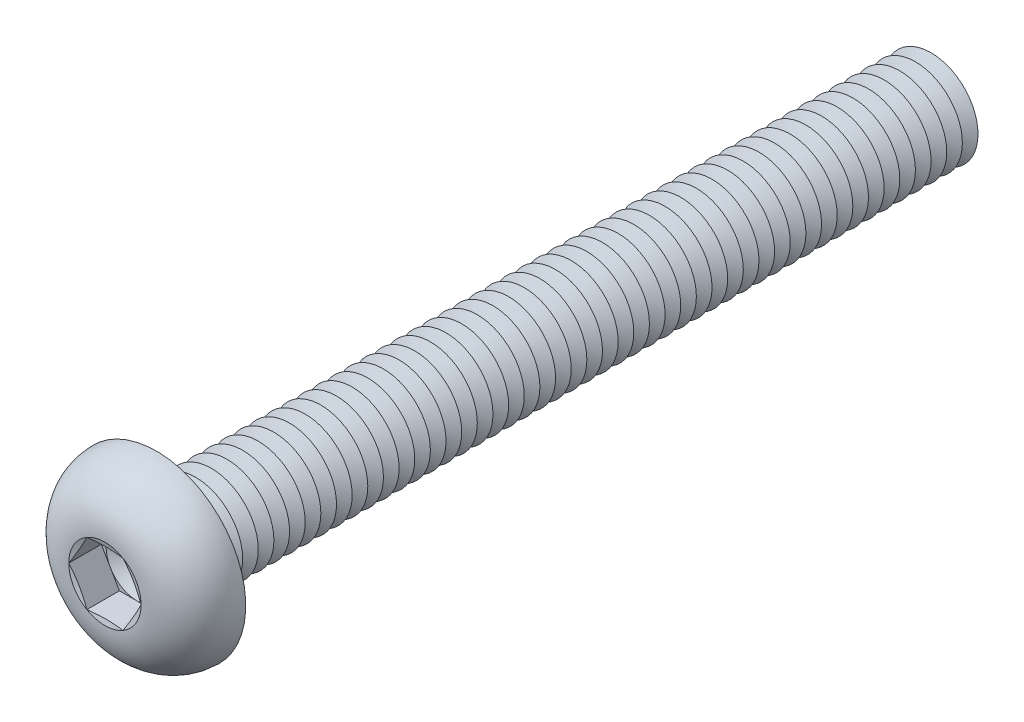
from build123d import *

# Parameters (mm, degrees)
FILLET1_R          = 0.25
LPATTERN1_COUNT    = 50
LPATTERN1_PITCH    = 0.5
CUT_EXTRUDE1_DEPTH = 1.04


with BuildPart() as part:
    # Sketch1 → Revolve1 (revolve)
    with BuildSketch(Plane(origin=(0, 0, 0), x_dir=(0, 0, -1), z_dir=(1, 0, 0)), mode=Mode.PRIVATE) as revolve1_sk:
        with BuildLine():
            Line((0, 1.5), (0, 2.85))
            ThreePointArc((0, 2.85), (-1.182850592, 2.35063849), (-1.65, 1.1547))
            Line((-1.65, 1.1547), (-1.495299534, 0.57735))
            Line((-1.495299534, 0.57735), (-1.65, 0.57735))
            Line((-1.65, 0.57735), (-1.65, 0))
            Line((-1.65, 0), (25, 0))
            Line((25, 0), (25, 1.5))
            Line((25, 1.5), (0, 1.5))
        make_face()
    revolve(revolve1_sk.sketch.rotate(Axis((0, 0, -25), (0, 0, 1)), 90), axis=Axis((0, 0, -25), (0, 0, 1)))

    # Fillet1
    fillet1_edges = [part.edges().sort_by_distance(p)[0] for p in [
        (1.5, 0, 0),
    ]]
    fillet(fillet1_edges, radius=FILLET1_R)

    # Sketch2 → Cut-Revolve1 (revolve, cut)
    with BuildSketch(Plane(origin=(0, 0, 0), x_dir=(0, 0, -1), z_dir=(1, 0, 0)), mode=Mode.PRIVATE) as cut_revolve1_sk:
        Polygon((24.75, 1.5), (25.25, 1.5), (25, 1.066987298), align=None)
    cut_revolve1 = revolve(cut_revolve1_sk.sketch.rotate(Axis((0, 0, -25), (0, 0, -1)), 270), axis=Axis((0, 0, -25), (0, 0, -1)), mode=Mode.SUBTRACT)

    # LPattern1: Cut-Revolve1 ×50
    with Locations(*[(0, 0, i * LPATTERN1_PITCH) for i in range(1, LPATTERN1_COUNT)]):
        add(cut_revolve1, mode=Mode.SUBTRACT)

    # Sketch3 → Cut-Extrude1 (cut)
    with BuildSketch(Plane.XY.offset(1.65)):
        Polygon((0.57735, 0.999999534), (-0.57735, 0.999999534), (-1.1547, 0), (-0.57735, -0.999999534), (0.57735, -0.999999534), (1.1547, 0), align=None)
    extrude(amount=-CUT_EXTRUDE1_DEPTH, mode=Mode.SUBTRACT)

    # Cut-Extrude2 cone 1 section (on through the dimple's axis) → Cut-Extrude2 (revolve, cut)
    with BuildSketch(Plane(origin=(0, 0, 0.61), x_dir=(0, -1, 0), z_dir=(1, 0, 0))):
        Polygon((0, 0), (0.999999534, 0), (0, 0.57735), align=None)
    revolve(axis=Axis((0, 0, 0.61), (0, 0, -1)), mode=Mode.SUBTRACT)


solid = part.part
